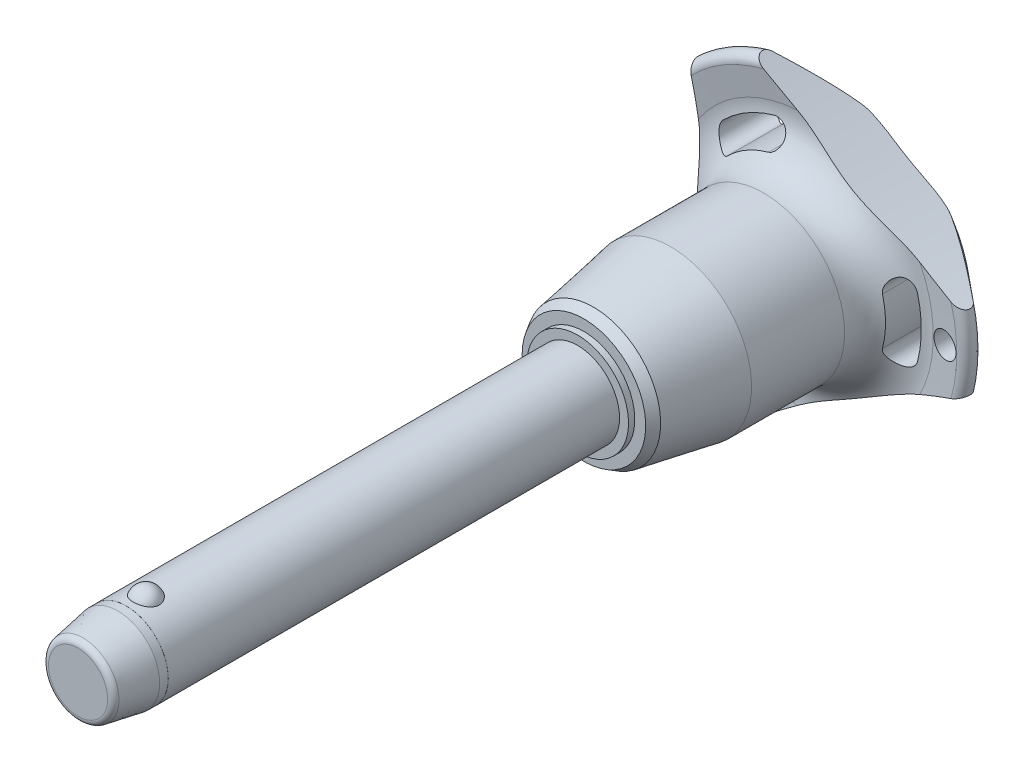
from build123d import *

# Parameters (mm, degrees)
SKETCH1_R           = 5
BOSS_EXTRUDE1_DEPTH = 50
SKETCH2_R           = 4.25
BOSS_EXTRUDE2_DEPTH = 33.3
BOSS_EXTRUDE3_START = 9.6
SKETCH1_2_R         = 5
BOSS_EXTRUDE3_DEPTH = 9.6
CHAMFER1_SIZE       = 4.8
CHAMFER1_SIZE2      = 0.846369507
FILLET1_R           = 0.75
SKETCH6_R           = 102.8
CUT_EXTRUDE1_DEPTH  = 88.794135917
CIRPATTERN1_COUNT   = 3
SKETCH7_R           = 1.5
CUT_EXTRUDE2_DEPTH  = 88.609718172
SKETCH8_R           = 5
SKETCH8_R_2         = 4.99
CUT_EXTRUDE3_DEPTH  = 5.76


with BuildPart() as part:
    # Sketch1 → Boss-Extrude1 (new body)
    with BuildSketch(Plane.XY):
        Circle(SKETCH1_R)
    extrude(amount=-BOSS_EXTRUDE1_DEPTH)

    # Sketch2 → Boss-Extrude2 (add)
    with BuildSketch(Plane(origin=(0, 0, -50), x_dir=(-1, 0, 0), z_dir=(0, 0, -1))):
        Circle(SKETCH2_R)
    extrude(amount=BOSS_EXTRUDE2_DEPTH)

    # Sketch3 → Revolve1 (revolve)
    with BuildSketch(Plane(origin=(0, 0, 0), x_dir=(0, 0, -1), z_dir=(1, 0, 0))):
        with BuildLine():
            Line((-1.516575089, 6), (-1.516575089, 2.7))
            ThreePointArc((-1.516575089, 2.7), (0.133424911, 4.35), (-1.516575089, 6))
        make_face()
        with BuildLine():
            Line((-1.516575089, -2.7), (-1.516575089, -6))
            ThreePointArc((-1.516575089, -6), (0.133424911, -4.35), (-1.516575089, -2.7))
        make_face()
    revolve(axis=Axis((0, -2.7, 1.516575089), (0, 1, 0)))

    # Sketch1_2 → Boss-Extrude3 (add)
    with BuildSketch(Plane.XY.offset(BOSS_EXTRUDE3_START)):
        Circle(SKETCH1_2_R)
    extrude(amount=-BOSS_EXTRUDE3_DEPTH)

    # Chamfer1
    chamfer1_edges = [part.edges().sort_by_distance(p)[0] for p in [
        (-5, 0, 9.6),
    ]]
    chamfer1_side = [part.faces().sort_by_distance(p)[0] for p in [
        (-5, 0, -20.2),
    ]]
    chamfer(chamfer1_edges, length=CHAMFER1_SIZE, length2=CHAMFER1_SIZE2, reference=chamfer1_side[0])

    # Fillet1
    fillet1_edges = [part.edges().sort_by_distance(p)[0] for p in [
        (-4.153630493, 0, 9.6),
        (4.25, 0, -83.3),
    ]]
    fillet(fillet1_edges, radius=FILLET1_R)

    # Sketch4 → Revolve2 (revolve)
    with BuildSketch(Plane(origin=(0, 0, 0), x_dir=(0, 0, -1), z_dir=(1, 0, 0)), mode=Mode.PRIVATE) as revolve2_sk:
        Polygon((50, 0), (50, 6.067402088), (50.75, 6.067402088), (50.75, 7.371950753), (51.879772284, 8.024225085), (61.1, 9.65), (72.2, 9.65), (72.2, 0), align=None)
    revolve(revolve2_sk.sketch.rotate(Axis((0, 0, -72.2), (0, 0, 1)), 90), axis=Axis((0, 0, -72.2), (0, 0, 1)))

    # Sketch5 → Revolve3 (revolve)
    with BuildSketch(Plane(origin=(0, 0, 0), x_dir=(0, 0, -1), z_dir=(1, 0, 0)), mode=Mode.PRIVATE) as revolve3_sk:
        with BuildLine():
            Line((77.16082631, 15.274661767), (76.757834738, 18.475067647))
            ThreePointArc((76.757834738, 18.475067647), (77.349836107, 19.516443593), (78.516044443, 19.24278761))
            Line((78.516044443, 19.24278761), (82.835691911, 14.094832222))
            ThreePointArc((82.835691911, 14.094832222), (83.3, 12.689260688), (82.67067517, 11.349423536))
            ThreePointArc((82.67067517, 11.349423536), (79.033110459, 6.185112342), (77.75, 0))
            Line((77.75, 0), (72.2, 0))
            Line((72.2, 0), (72.2, 9.65))
            ThreePointArc((72.2, 9.65), (75.949887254, 11.342683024), (77.16082631, 15.274661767))
        make_face()
    revolve(revolve3_sk.sketch.rotate(Axis((0, 0, -77.75), (0, 0, 1)), 90), axis=Axis((0, 0, -77.75), (0, 0, 1)))

    # Sketch6 → Cut-Extrude1 (cut, through all)
    with BuildSketch(Plane.XY):
        with Locations((-115.2, 0)):
            Circle(SKETCH6_R)
        with BuildLine():
            ThreePointArc((13.411913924, -3.529271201), (13.868496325, 0), (13.411913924, 3.529271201))
            ThreePointArc((13.411913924, 3.529271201), (11.694200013, 4.531299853), (10.692171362, 2.813585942))
            ThreePointArc((10.692171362, 2.813585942), (11.056165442, 0), (10.692171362, -2.813585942))
            ThreePointArc((10.692171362, -2.813585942), (11.694200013, -4.531299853), (13.411913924, -3.529271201))
        make_face()
    cut_extrude1 = extrude(amount=-CUT_EXTRUDE1_DEPTH, mode=Mode.SUBTRACT)

    # CirPattern1: Cut-Extrude1 ×3 about axis
    cirpattern1_axis = Axis((0, 0, 0), (0, 0, 1))
    for i in range(1, CIRPATTERN1_COUNT):
        add(cut_extrude1.rotate(cirpattern1_axis, i * 360 / CIRPATTERN1_COUNT), mode=Mode.SUBTRACT)

    # Sketch7 → Cut-Extrude2 (cut, through all)
    with BuildSketch(Plane.XY):
        with Locations(Location((16.868496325, 0, 0), (0, 0, 225.467095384))):
            Circle(SKETCH7_R)
    extrude(amount=-CUT_EXTRUDE2_DEPTH, mode=Mode.SUBTRACT)

    # Sketch8 → Cut-Extrude3 (cut)
    with BuildSketch(Plane.XY.offset(9.6)):
        Circle(SKETCH8_R)
        Circle(SKETCH8_R_2, mode=Mode.SUBTRACT)
    extrude(amount=-CUT_EXTRUDE3_DEPTH, mode=Mode.SUBTRACT)


solid = part.part
